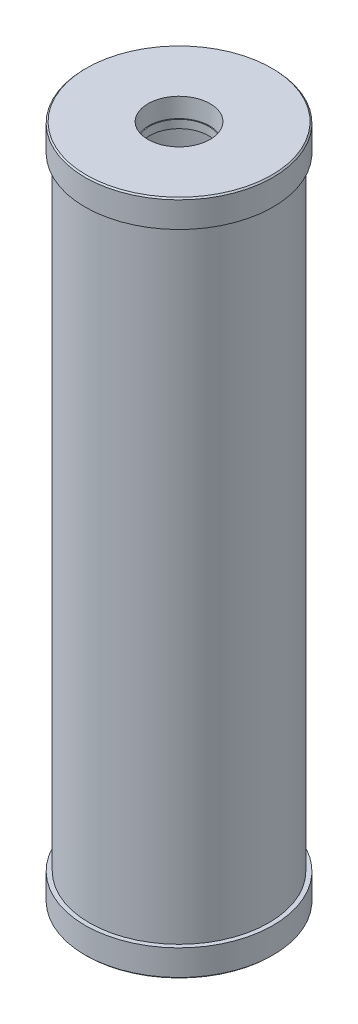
from build123d import *

# Parameters (mm, degrees)
SKETCH1_R           = 84.201
SKETCH1_R_2         = 74.676
BOSS_EXTRUDE1_DEPTH = 635
SKETCH2_R           = 88.265
BOSS_EXTRUDE2_DEPTH = 25.4
BOSS_EXTRUDE3_START = -25.4
SKETCH3_R           = 88.265
BOSS_EXTRUDE3_DEPTH = 25.4
CHAMFER1_SIZE       = 1.27


with BuildPart() as part:
    # Sketch1 → Boss-Extrude1 (new body)
    with BuildSketch(Plane(origin=(0, 0, 0), x_dir=(1, 0, 0), z_dir=(0, 1, 0))):
        with Locations(Location((0, 0, 0), (0, 0, 90))):
            Circle(SKETCH1_R)
        with Locations(Location((0, 0, 0), (0, 0, 90))):
            Circle(SKETCH1_R_2, mode=Mode.SUBTRACT)
    extrude(amount=BOSS_EXTRUDE1_DEPTH)

    # Sketch2 → Boss-Extrude2 (add)
    with BuildSketch(Plane(origin=(0, 0, 0), x_dir=(1, 0, 0), z_dir=(0, 1, 0))):
        with Locations(Location((0, 0, 0), (0, 0, 270))):
            Circle(SKETCH2_R)
    extrude(amount=BOSS_EXTRUDE2_DEPTH)

    # Sketch3 → Boss-Extrude3 (add)
    with BuildSketch(Plane(origin=(0, 635, 0), x_dir=(1, 0, 0), z_dir=(0, 1, 0)).offset(BOSS_EXTRUDE3_START)):
        with Locations(Location((0, 0, 0), (0, 0, 270))):
            Circle(SKETCH3_R)
    extrude(amount=BOSS_EXTRUDE3_DEPTH)

    # Sketch4 → 2 NPT Tapped Hole1 (revolve, cut)
    with BuildSketch(Plane(origin=(0, 635, 0), x_dir=(0, 0, 1), z_dir=(1, 0, 0))):
        Polygon((0, 0), (0, 45.652474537), (27.7876, 28.956), (27.7876, 17.78), (28.63263419, 17.78), (29.1649912, 0), align=None)
    revolve(axis=Axis((0, 641.35, 0), (0, -1, 0)), mode=Mode.SUBTRACT)

    # Sketch10 → 2 NPT Tapped Hole3 (revolve, cut)
    with BuildSketch(Plane(origin=(0, 0, 0), x_dir=(0, 0, -1), z_dir=(1, 0, 0))):
        Polygon((0, 0), (0, 45.652474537), (27.7876, 28.956), (27.7876, 17.78), (28.63263419, 17.78), (29.1649912, 0), align=None)
    revolve(axis=Axis((0, -6.35, 0), (0, 1, 0)), mode=Mode.SUBTRACT)

    # Chamfer1
    chamfer1_edges = [part.edges().sort_by_distance(p)[0] for p in [
        (0, 0, -88.265),
        (0, 635, -88.265),
    ]]
    chamfer(chamfer1_edges, length=CHAMFER1_SIZE)


solid = part.part
